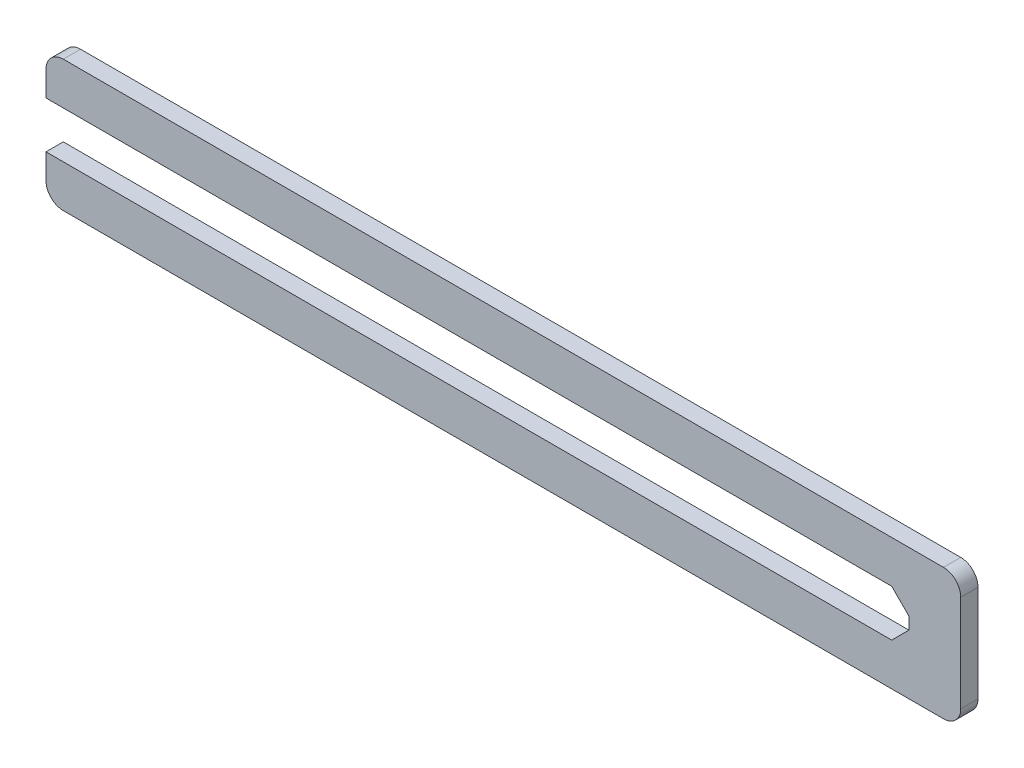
from build123d import *

# Parameters (mm, degrees)
ESQUISSE1_W      = 265
ESQUISSE1_H      = 38
EXTRUSION1_DEPTH = 5
EXTRUSION2_DEPTH = 6
CONG_1_R         = 5


with BuildPart() as part:
    # Esquisse1 → Extrusion1 (new body)
    with BuildSketch(Plane.XY):
        with Locations((132.5, 19)):
            Rectangle(ESQUISSE1_W, ESQUISSE1_H)
    extrude(amount=EXTRUSION1_DEPTH)

    # Esquisse2 → Extrusion2 (cut)
    with BuildSketch(Plane.XY.offset(5)):
        Polygon((0, 25.75), (245, 25.75), (250, 20.75), (250, 17.25), (245, 12.25), (0, 12.25), align=None)
    extrude(amount=-EXTRUSION2_DEPTH, mode=Mode.SUBTRACT)

    # Cong_1
    cong_1_edges = [part.edges().sort_by_distance(p)[0] for p in [
        (0, 38, 2.5),
        (265, 38, 2.5),
        (265, 0, 2.5),
        (0, 0, 2.5),
    ]]
    fillet(cong_1_edges, radius=CONG_1_R)


solid = part.part
